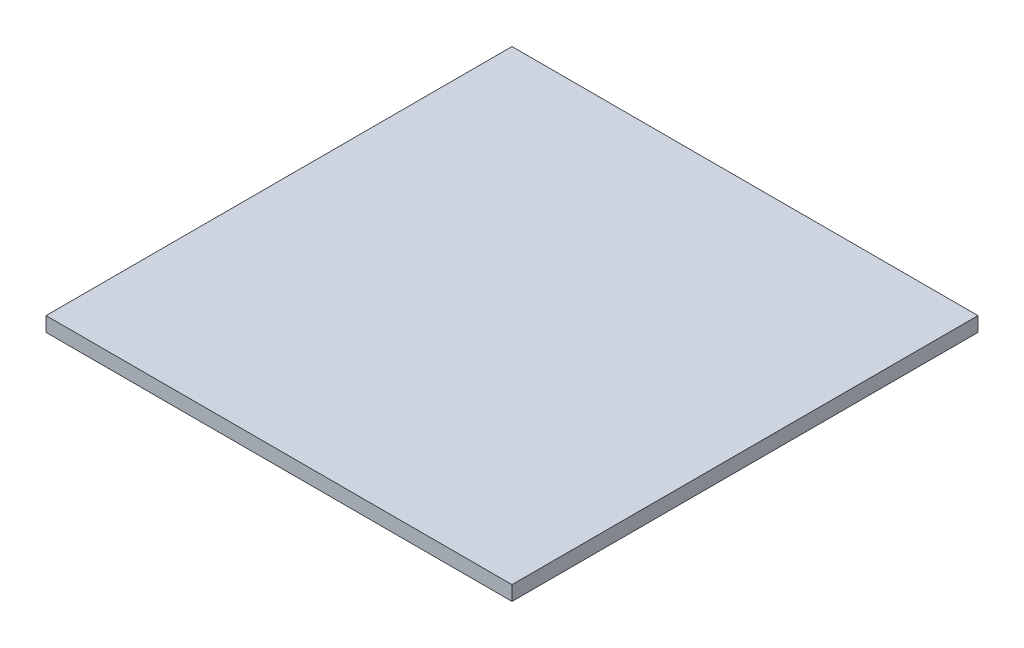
from build123d import *

# Parameters (mm, degrees)
SKETCH1_W      = 406.4
SKETCH1_H      = 406.4
EXTRUDE1_DEPTH = 12.7


with BuildPart() as part:
    # Sketch1 → Extrude1 (new body)
    with BuildSketch(Plane(origin=(0, 0, 0), x_dir=(1, 0, 0), z_dir=(0, 1, 0))):
        Rectangle(SKETCH1_W, SKETCH1_H)
    extrude(amount=EXTRUDE1_DEPTH)


solid = part.part
